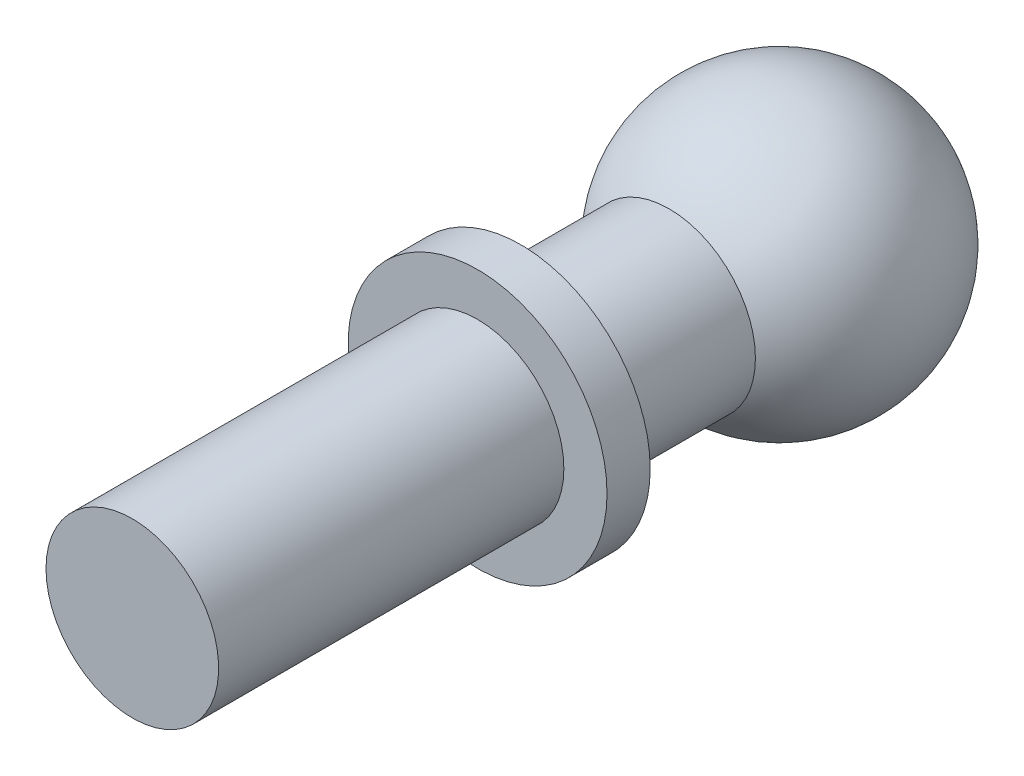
from build123d import *

# Parameters (mm, degrees)
BOSS_EXTRUDE1_START = -16
SKETCH2_R           = 6
BOSS_EXTRUDE1_DEPTH = 2


with BuildPart() as part:
    # Sketch1 → Revolve1 (revolve)
    with BuildSketch(Plane(origin=(0, 0, 0), x_dir=(1, 0, 0), z_dir=(0, 1, 0))):
        with BuildLine():
            Line((0, 6.5), (0, 0))
            Line((0, 0), (0, -30))
            Line((0, -30), (4, -30))
            Line((4, -30), (4, -5.123475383))
            ThreePointArc((4, -5.123475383), (6.146242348, 2.115113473), (0, 6.5))
        make_face()
    revolve(axis=Axis((0, 0, 0), (0, 0, 1)))

    # Sketch2 → Boss-Extrude1 (add)
    with BuildSketch(Plane.XY.offset(30).offset(BOSS_EXTRUDE1_START)):
        Circle(SKETCH2_R)
    extrude(amount=-BOSS_EXTRUDE1_DEPTH)


solid = part.part
